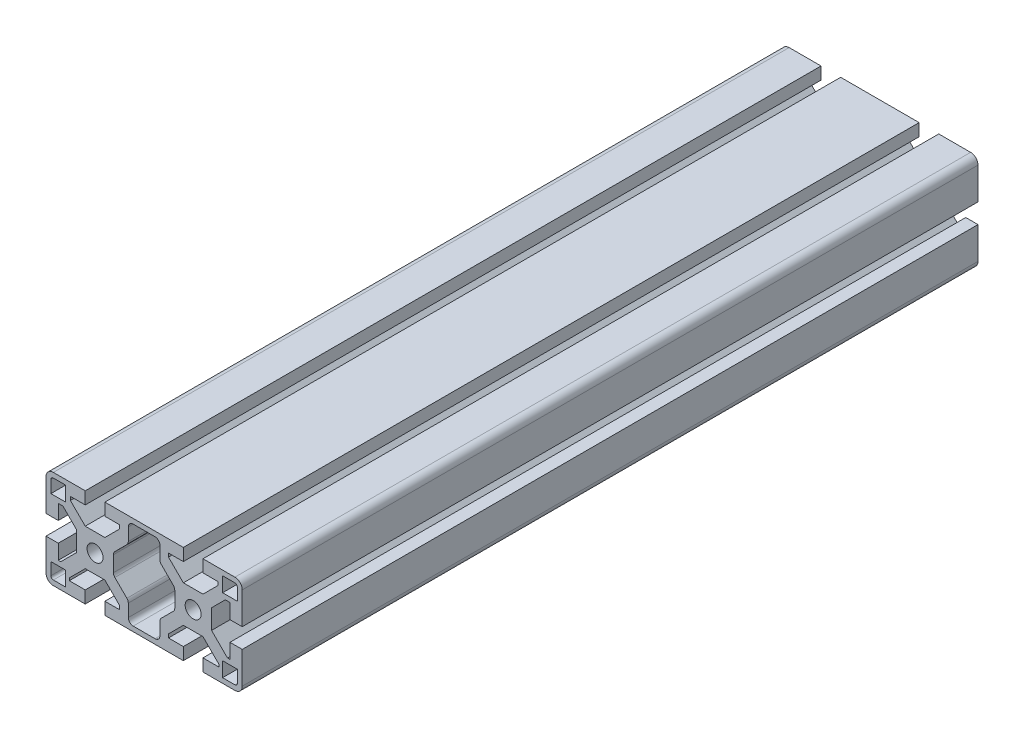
from build123d import *

# Parameters (mm, degrees)
CROQUIS1_R     = 3.25
EXTRUIR5_DEPTH = 300


with BuildPart() as part:
    # Croquis1 → Extruir5 (new body)
    with BuildSketch(Plane.XY):
        with BuildLine():
            Line((50.062875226, 13.55), (50.062875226, 15))
            Line((50.062875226, 15), (44, 15))
            Line((44, 15), (44, 20))
            Line((44, 20), (57, 20))
            ThreePointArc((57, 20), (59.121320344, 19.121320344), (60, 17))
            Line((60, 17), (60, 4))
            Line((60, 4), (55, 4))
            Line((55, 4), (55, 10.05))
            Line((55, 10.05), (53.1, 10.05))
            Line((53.1, 10.05), (47.5, 4.45))
            Line((47.5, 4.45), (47.5, -3.55))
            Line((47.5, -3.55), (54, -10.05))
            Line((54, -10.05), (55, -10.05))
            Line((55, -10.05), (55, -4))
            Line((55, -4), (60, -4))
            Line((60, -4), (60, -17))
            ThreePointArc((60, -17), (59.121320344, -19.121320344), (57, -20))
            Line((57, -20), (44, -20))
            Line((44, -20), (44, -15))
            Line((44, -15), (50.5, -15))
            Line((50.5, -15), (50.5, -14))
            Line((50.5, -14), (44, -7.5))
            Line((44, -7.5), (36, -7.5))
            Line((36, -7.5), (29.95, -13.55))
            Line((29.95, -13.55), (29.95, -15))
            Line((29.95, -15), (36, -15))
            Line((36, -15), (36, -20))
            Line((36, -20), (4, -20))
            Line((4, -20), (4, -15))
            Line((4, -15), (10.05, -15))
            Line((10.05, -15), (10.05, -13.55))
            Line((10.05, -13.55), (4, -7.5))
            Line((4, -7.5), (-4, -7.5))
            Line((-4, -7.5), (-10.5, -14))
            Line((-10.5, -14), (-10.5, -15))
            Line((-10.5, -15), (-4, -15))
            Line((-4, -15), (-4, -20))
            Line((-4, -20), (-17, -20))
            ThreePointArc((-17, -20), (-19.121320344, -19.121320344), (-20, -17))
            Line((-20, -17), (-20, -4))
            Line((-20, -4), (-15, -4))
            Line((-15, -4), (-15, -10.05))
            Line((-15, -10.05), (-14, -10.05))
            Line((-14, -10.05), (-7.5, -3.55))
            Line((-7.5, -3.55), (-7.5, 4.45))
            Line((-7.5, 4.45), (-13.1, 10.05))
            Line((-13.1, 10.05), (-15, 10.05))
            Line((-15, 10.05), (-15, 4))
            Line((-15, 4), (-20, 4))
            Line((-20, 4), (-20, 17))
            ThreePointArc((-20, 17), (-19.121320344, 19.121320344), (-17, 20))
            Line((-17, 20), (-4, 20))
            Line((-4, 20), (-4, 15))
            Line((-4, 15), (-10.062875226, 15))
            Line((-10.062875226, 15), (-10.062875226, 13.55))
            Line((-10.062875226, 13.55), (-4, 7.5))
            Line((-4, 7.5), (4, 7.5))
            Line((4, 7.5), (10.05, 13.55))
            Line((10.05, 13.55), (10.05, 15))
            Line((10.05, 15), (4, 15))
            Line((4, 15), (4, 20))
            Line((4, 20), (36, 20))
            Line((36, 20), (36, 15))
            Line((36, 15), (29.95, 15))
            Line((29.95, 15), (29.95, 13.55))
            Line((29.95, 13.55), (36, 7.5))
            Line((36, 7.5), (44, 7.5))
            Line((44, 7.5), (50.062875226, 13.55))
        make_face()
        Circle(CROQUIS1_R, mode=Mode.SUBTRACT)
        with Locations(Location((40, 0, 0), (0, 0, 180))):
            Circle(CROQUIS1_R, mode=Mode.SUBTRACT)
        with BuildLine():
            Line((-18, 12), (-12, 12))
            Line((-12, 12), (-12, 18))
            Line((-12, 18), (-17, 18))
            ThreePointArc((-17, 18), (-17.707106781, 17.707106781), (-18, 17))
            Line((-18, 17), (-18, 12))
        make_face(mode=Mode.SUBTRACT)
        with BuildLine():
            Line((24.45, 18), (15.55, 18))
            ThreePointArc((15.55, 18), (14.135786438, 17.414213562), (13.55, 16))
            Line((13.55, 16), (13.55, 10.878427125))
            ThreePointArc((13.55, 10.878427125), (13.397759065, 10.11306026), (12.964213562, 9.464213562))
            Line((12.964213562, 9.464213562), (8.085786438, 4.585786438))
            ThreePointArc((8.085786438, 4.585786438), (7.652240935, 3.93693974), (7.5, 3.171572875))
            Line((7.5, 3.171572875), (7.5, -3.171572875))
            ThreePointArc((7.5, -3.171572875), (7.652240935, -3.93693974), (8.085786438, -4.585786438))
            Line((8.085786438, -4.585786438), (12.964213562, -9.464213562))
            ThreePointArc((12.964213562, -9.464213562), (13.397759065, -10.11306026), (13.55, -10.878427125))
            Line((13.55, -10.878427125), (13.55, -16))
            ThreePointArc((13.55, -16), (14.135786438, -17.414213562), (15.55, -18))
            Line((15.55, -18), (24.45, -18))
            ThreePointArc((24.45, -18), (25.864213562, -17.414213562), (26.45, -16))
            Line((26.45, -16), (26.45, -10.878427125))
            ThreePointArc((26.45, -10.878427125), (26.602240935, -10.11306026), (27.035786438, -9.464213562))
            Line((27.035786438, -9.464213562), (31.914213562, -4.585786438))
            ThreePointArc((31.914213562, -4.585786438), (32.347759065, -3.93693974), (32.5, -3.171572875))
            Line((32.5, -3.171572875), (32.5, 3.171572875))
            ThreePointArc((32.5, 3.171572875), (32.347759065, 3.93693974), (31.914213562, 4.585786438))
            Line((31.914213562, 4.585786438), (27.035786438, 9.464213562))
            ThreePointArc((27.035786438, 9.464213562), (26.602240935, 10.11306026), (26.45, 10.878427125))
            Line((26.45, 10.878427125), (26.45, 16))
            ThreePointArc((26.45, 16), (25.864213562, 17.414213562), (24.45, 18))
        make_face(mode=Mode.SUBTRACT)
        with BuildLine():
            Line((-17, -18), (-12, -18))
            Line((-12, -18), (-12, -12))
            Line((-12, -12), (-18, -12))
            Line((-18, -12), (-18, -17))
            ThreePointArc((-18, -17), (-17.707106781, -17.707106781), (-17, -18))
        make_face(mode=Mode.SUBTRACT)
        with BuildLine():
            Line((58, -17), (58, -12))
            Line((58, -12), (52, -12))
            Line((52, -12), (52, -18))
            Line((52, -18), (57, -18))
            ThreePointArc((57, -18), (57.707106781, -17.707106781), (58, -17))
        make_face(mode=Mode.SUBTRACT)
        with BuildLine():
            Line((58, 12), (58, 17))
            ThreePointArc((58, 17), (57.707106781, 17.707106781), (57, 18))
            Line((57, 18), (52, 18))
            Line((52, 18), (52, 12))
            Line((52, 12), (58, 12))
        make_face(mode=Mode.SUBTRACT)
    extrude(amount=EXTRUIR5_DEPTH)


solid = part.part
